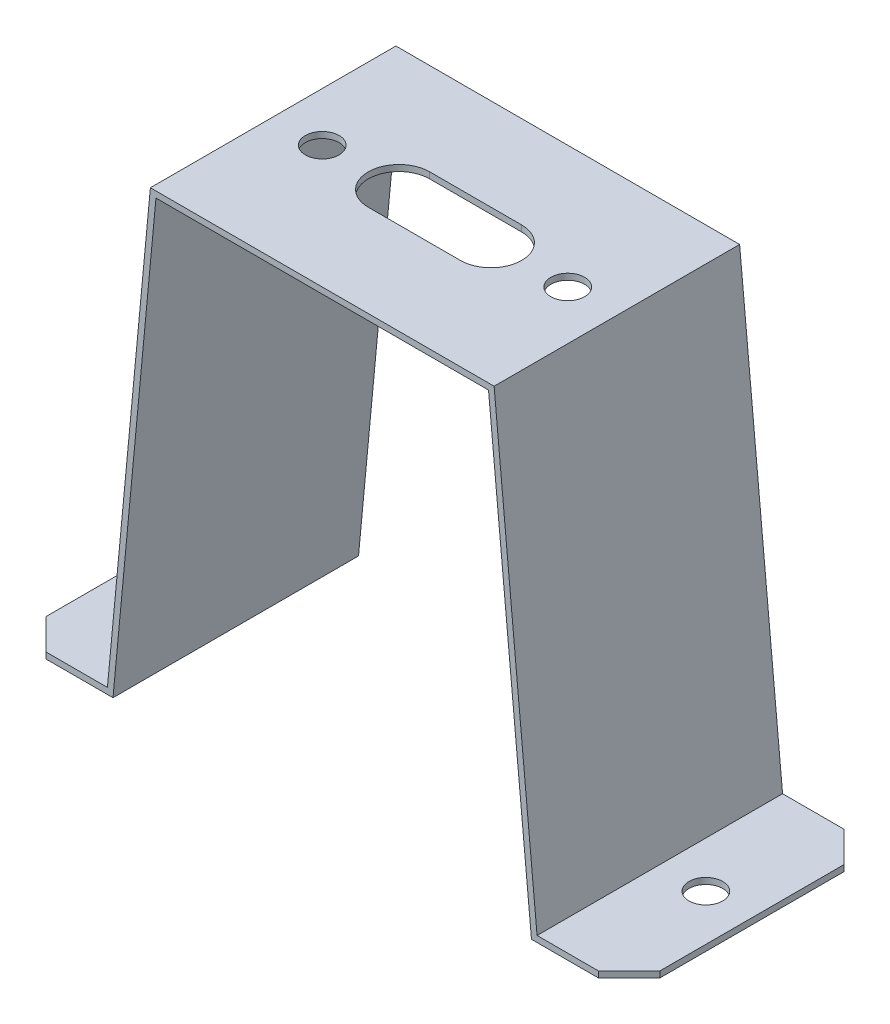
ISO-10303-21;
HEADER;
FILE_DESCRIPTION(('STEP AP214'),'2;1');
FILE_NAME('part.step','',(''),(''),'','','');
FILE_SCHEMA(('AUTOMOTIVE_DESIGN { 1 0 10303 214 1 1 1 1 }'));
ENDSEC;
DATA;
#1=APPLICATION_CONTEXT('core data for automotive mechanical design processes');
#2=APPLICATION_PROTOCOL_DEFINITION('international standard','automotive_design',2000,#1);
#3=PRODUCT_CONTEXT('',#1,'mechanical');
#4=PRODUCT('Part','Part','',(#3));
#5=PRODUCT_RELATED_PRODUCT_CATEGORY('part','',(#4));
#6=PRODUCT_DEFINITION_FORMATION('','',#4);
#7=PRODUCT_DEFINITION_CONTEXT('part definition',#1,'design');
#8=PRODUCT_DEFINITION('design','',#6,#7);
#9=PRODUCT_DEFINITION_SHAPE('','',#8);
#10=(LENGTH_UNIT() NAMED_UNIT(*) SI_UNIT(.MILLI.,.METRE.));
#11=(NAMED_UNIT(*) PLANE_ANGLE_UNIT() SI_UNIT($,.RADIAN.));
#12=(NAMED_UNIT(*) SI_UNIT($,.STERADIAN.) SOLID_ANGLE_UNIT());
#13=UNCERTAINTY_MEASURE_WITH_UNIT(LENGTH_MEASURE(1.E-05),#10,'distance_accuracy_value','');
#14=(GEOMETRIC_REPRESENTATION_CONTEXT(3) GLOBAL_UNCERTAINTY_ASSIGNED_CONTEXT((#13)) GLOBAL_UNIT_ASSIGNED_CONTEXT((#10,
#11,#12)) REPRESENTATION_CONTEXT('',''));
#15=CARTESIAN_POINT('',(0.,0.,0.));
#16=DIRECTION('',(0.,0.,1.));
#17=DIRECTION('',(1.,0.,0.));
#18=AXIS2_PLACEMENT_3D('',#15,#16,#17);
#19=CARTESIAN_POINT('',(0.,0.,40.));
#20=DIRECTION('',(1.,0.,0.));
#21=DIRECTION('',(0.,0.,-1.));
#22=AXIS2_PLACEMENT_3D('',#19,#20,#21);
#23=PLANE('',#22);
#24=DIRECTION('',(0.,0.,-1.));
#25=VECTOR('',#24,1.);
#26=CARTESIAN_POINT('',(0.,0.,40.));
#27=LINE('',#26,#25);
#28=CARTESIAN_POINT('',(0.,0.,35.));
#29=VERTEX_POINT('',#28);
#30=CARTESIAN_POINT('',(0.,0.,5.00000000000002));
#31=VERTEX_POINT('',#30);
#32=EDGE_CURVE('E286',#29,#31,#27,.T.);
#33=ORIENTED_EDGE('',*,*,#32,.F.);
#34=DIRECTION('',(0.,1.,0.));
#35=VECTOR('',#34,1.);
#36=CARTESIAN_POINT('',(0.,0.,35.));
#37=LINE('',#36,#35);
#38=CARTESIAN_POINT('',(0.,1.,35.));
#39=VERTEX_POINT('',#38);
#40=EDGE_CURVE('E299',#29,#39,#37,.T.);
#41=ORIENTED_EDGE('',*,*,#40,.T.);
#42=DIRECTION('',(0.,0.,-1.));
#43=VECTOR('',#42,1.);
#44=CARTESIAN_POINT('',(0.,1.,40.));
#45=LINE('',#44,#43);
#46=CARTESIAN_POINT('',(0.,1.,5.00000000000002));
#47=VERTEX_POINT('',#46);
#48=EDGE_CURVE('E254',#39,#47,#45,.T.);
#49=ORIENTED_EDGE('',*,*,#48,.T.);
#50=DIRECTION('',(0.,-1.,0.));
#51=VECTOR('',#50,1.);
#52=CARTESIAN_POINT('',(0.,0.,5.));
#53=LINE('',#52,#51);
#54=EDGE_CURVE('E296',#47,#31,#53,.T.);
#55=ORIENTED_EDGE('',*,*,#54,.T.);
#56=EDGE_LOOP('',(#33,#41,#49,#55));
#57=FACE_BOUND('',#56,.T.);
#58=ADVANCED_FACE('F30',(#57),#23,.F.);
#59=CARTESIAN_POINT('',(0.,0.,40.));
#60=DIRECTION('',(0.,1.,0.));
#61=DIRECTION('',(0.,0.,1.));
#62=AXIS2_PLACEMENT_3D('',#59,#60,#61);
#63=PLANE('',#62);
#64=CARTESIAN_POINT('',(7.5,0.,20.));
#65=DIRECTION('',(0.,1.,0.));
#66=DIRECTION('',(0.,0.,1.));
#67=AXIS2_PLACEMENT_3D('',#64,#65,#66);
#68=CIRCLE('',#67,2.75);
#69=CARTESIAN_POINT('',(7.5,0.,22.75));
#70=VERTEX_POINT('',#69);
#71=EDGE_CURVE('E619',#70,#70,#68,.T.);
#72=ORIENTED_EDGE('',*,*,#71,.T.);
#73=EDGE_LOOP('',(#72));
#74=FACE_BOUND('',#73,.T.);
#75=DIRECTION('',(1.,0.,0.));
#76=VECTOR('',#75,1.);
#77=CARTESIAN_POINT('',(0.,0.,40.));
#78=LINE('',#77,#76);
#79=CARTESIAN_POINT('',(5.00000000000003,0.,40.));
#80=VERTEX_POINT('',#79);
#81=CARTESIAN_POINT('',(15.909869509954,0.,40.));
#82=VERTEX_POINT('',#81);
#83=EDGE_CURVE('E232',#80,#82,#78,.T.);
#84=ORIENTED_EDGE('',*,*,#83,.F.);
#85=DIRECTION('',(0.707106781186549,0.,0.707106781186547));
#86=VECTOR('',#85,1.);
#87=CARTESIAN_POINT('',(5.00000000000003,0.,40.));
#88=LINE('',#87,#86);
#89=EDGE_CURVE('E294',#80,#29,#88,.F.);
#90=ORIENTED_EDGE('',*,*,#89,.T.);
#91=ORIENTED_EDGE('',*,*,#32,.T.);
#92=DIRECTION('',(0.707106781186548,0.,-0.707106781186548));
#93=VECTOR('',#92,1.);
#94=CARTESIAN_POINT('',(0.,0.,5.));
#95=LINE('',#94,#93);
#96=CARTESIAN_POINT('',(5.,0.,0.));
#97=VERTEX_POINT('',#96);
#98=EDGE_CURVE('E292',#31,#97,#95,.T.);
#99=ORIENTED_EDGE('',*,*,#98,.T.);
#100=DIRECTION('',(1.,0.,0.));
#101=VECTOR('',#100,1.);
#102=CARTESIAN_POINT('',(0.,0.,0.));
#103=LINE('',#102,#101);
#104=CARTESIAN_POINT('',(15.909869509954,0.,0.));
#105=VERTEX_POINT('',#104);
#106=EDGE_CURVE('E211',#97,#105,#103,.T.);
#107=ORIENTED_EDGE('',*,*,#106,.T.);
#108=DIRECTION('',(0.,0.,-1.));
#109=VECTOR('',#108,1.);
#110=CARTESIAN_POINT('',(15.909869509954,0.,40.));
#111=LINE('',#110,#109);
#112=EDGE_CURVE('E283',#82,#105,#111,.T.);
#113=ORIENTED_EDGE('',*,*,#112,.F.);
#114=EDGE_LOOP('',(#84,#90,#91,#99,#107,#113));
#115=FACE_BOUND('',#114,.T.);
#116=ADVANCED_FACE('F367',(#74,#115),#63,.F.);
#117=CARTESIAN_POINT('',(22.909869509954,74.,40.));
#118=DIRECTION('',(-0.995555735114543,0.0941741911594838,0.));
#119=DIRECTION('',(-0.0941741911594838,-0.995555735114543,0.));
#120=AXIS2_PLACEMENT_3D('',#117,#118,#119);
#121=PLANE('',#120);
#122=DIRECTION('',(0.0941741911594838,0.995555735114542,0.));
#123=VECTOR('',#122,1.);
#124=CARTESIAN_POINT('',(22.909869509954,74.,0.));
#125=LINE('',#124,#123);
#126=CARTESIAN_POINT('',(22.909869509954,74.,0.));
#127=VERTEX_POINT('',#126);
#128=EDGE_CURVE('E213',#105,#127,#125,.T.);
#129=ORIENTED_EDGE('',*,*,#128,.T.);
#130=DIRECTION('',(0.,0.,-1.));
#131=VECTOR('',#130,1.);
#132=CARTESIAN_POINT('',(22.909869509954,74.,40.));
#133=LINE('',#132,#131);
#134=CARTESIAN_POINT('',(22.909869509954,74.,40.));
#135=VERTEX_POINT('',#134);
#136=EDGE_CURVE('E280',#135,#127,#133,.T.);
#137=ORIENTED_EDGE('',*,*,#136,.F.);
#138=DIRECTION('',(0.0941741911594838,0.995555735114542,0.));
#139=VECTOR('',#138,1.);
#140=CARTESIAN_POINT('',(22.909869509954,74.,40.));
#141=LINE('',#140,#139);
#142=EDGE_CURVE('E234',#82,#135,#141,.T.);
#143=ORIENTED_EDGE('',*,*,#142,.F.);
#144=ORIENTED_EDGE('',*,*,#112,.T.);
#145=EDGE_LOOP('',(#129,#137,#143,#144));
#146=FACE_BOUND('',#145,.T.);
#147=ADVANCED_FACE('F374',(#146),#121,.F.);
#148=CARTESIAN_POINT('',(22.909869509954,74.,40.));
#149=DIRECTION('',(0.,1.,0.));
#150=DIRECTION('',(0.,0.,1.));
#151=AXIS2_PLACEMENT_3D('',#148,#149,#150);
#152=PLANE('',#151);
#153=CARTESIAN_POINT('',(30.,74.,20.));
#154=DIRECTION('',(0.,1.,0.));
#155=DIRECTION('',(0.,0.,1.));
#156=AXIS2_PLACEMENT_3D('',#153,#154,#155);
#157=CIRCLE('',#156,2.75);
#158=CARTESIAN_POINT('',(30.,74.,22.75));
#159=VERTEX_POINT('',#158);
#160=EDGE_CURVE('E632',#159,#159,#157,.T.);
#161=ORIENTED_EDGE('',*,*,#160,.T.);
#162=EDGE_LOOP('',(#161));
#163=FACE_BOUND('',#162,.T.);
#164=CARTESIAN_POINT('',(70.,74.,20.));
#165=DIRECTION('',(0.,1.,0.));
#166=DIRECTION('',(0.,0.,1.));
#167=AXIS2_PLACEMENT_3D('',#164,#165,#166);
#168=CIRCLE('',#167,2.75000000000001);
#169=CARTESIAN_POINT('',(70.,74.,22.75));
#170=VERTEX_POINT('',#169);
#171=EDGE_CURVE('E638',#170,#170,#168,.T.);
#172=ORIENTED_EDGE('',*,*,#171,.T.);
#173=EDGE_LOOP('',(#172));
#174=FACE_BOUND('',#173,.T.);
#175=DIRECTION('',(1.,0.,0.));
#176=VECTOR('',#175,1.);
#177=CARTESIAN_POINT('',(22.909869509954,74.,25.));
#178=LINE('',#177,#176);
#179=CARTESIAN_POINT('',(42.5,74.,25.));
#180=VERTEX_POINT('',#179);
#181=CARTESIAN_POINT('',(57.5,74.,25.));
#182=VERTEX_POINT('',#181);
#183=EDGE_CURVE('E205',#180,#182,#178,.T.);
#184=ORIENTED_EDGE('',*,*,#183,.T.);
#185=CARTESIAN_POINT('',(57.5,74.,20.));
#186=DIRECTION('',(0.,1.,0.));
#187=DIRECTION('',(0.,0.,1.));
#188=AXIS2_PLACEMENT_3D('',#185,#186,#187);
#189=CIRCLE('',#188,5.);
#190=CARTESIAN_POINT('',(57.5,74.,15.));
#191=VERTEX_POINT('',#190);
#192=EDGE_CURVE('E208',#182,#191,#189,.T.);
#193=ORIENTED_EDGE('',*,*,#192,.T.);
#194=DIRECTION('',(-1.,0.,0.));
#195=VECTOR('',#194,1.);
#196=CARTESIAN_POINT('',(22.909869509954,74.,15.));
#197=LINE('',#196,#195);
#198=CARTESIAN_POINT('',(42.5,74.,15.));
#199=VERTEX_POINT('',#198);
#200=EDGE_CURVE('E200',#191,#199,#197,.T.);
#201=ORIENTED_EDGE('',*,*,#200,.T.);
#202=CARTESIAN_POINT('',(42.5,74.,20.));
#203=DIRECTION('',(0.,1.,0.));
#204=DIRECTION('',(0.,0.,1.));
#205=AXIS2_PLACEMENT_3D('',#202,#203,#204);
#206=CIRCLE('',#205,5.);
#207=EDGE_CURVE('E175',#199,#180,#206,.T.);
#208=ORIENTED_EDGE('',*,*,#207,.T.);
#209=EDGE_LOOP('',(#184,#193,#201,#208));
#210=FACE_BOUND('',#209,.T.);
#211=DIRECTION('',(1.,0.,0.));
#212=VECTOR('',#211,1.);
#213=CARTESIAN_POINT('',(22.909869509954,74.,0.));
#214=LINE('',#213,#212);
#215=CARTESIAN_POINT('',(77.090130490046,74.,0.));
#216=VERTEX_POINT('',#215);
#217=EDGE_CURVE('E215',#127,#216,#214,.T.);
#218=ORIENTED_EDGE('',*,*,#217,.T.);
#219=DIRECTION('',(0.,0.,-1.));
#220=VECTOR('',#219,1.);
#221=CARTESIAN_POINT('',(77.090130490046,74.,40.));
#222=LINE('',#221,#220);
#223=CARTESIAN_POINT('',(77.090130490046,74.,40.));
#224=VERTEX_POINT('',#223);
#225=EDGE_CURVE('E277',#224,#216,#222,.T.);
#226=ORIENTED_EDGE('',*,*,#225,.F.);
#227=DIRECTION('',(1.,0.,0.));
#228=VECTOR('',#227,1.);
#229=CARTESIAN_POINT('',(22.909869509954,74.,40.));
#230=LINE('',#229,#228);
#231=EDGE_CURVE('E236',#135,#224,#230,.T.);
#232=ORIENTED_EDGE('',*,*,#231,.F.);
#233=ORIENTED_EDGE('',*,*,#136,.T.);
#234=EDGE_LOOP('',(#218,#226,#232,#233));
#235=FACE_BOUND('',#234,.T.);
#236=ADVANCED_FACE('F378',(#163,#174,#210,#235),#152,.F.);
#237=CARTESIAN_POINT('',(77.090130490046,74.,40.));
#238=DIRECTION('',(0.995555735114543,0.0941741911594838,0.));
#239=DIRECTION('',(-0.0941741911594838,0.995555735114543,0.));
#240=AXIS2_PLACEMENT_3D('',#237,#238,#239);
#241=PLANE('',#240);
#242=DIRECTION('',(0.0941741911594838,-0.995555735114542,0.));
#243=VECTOR('',#242,1.);
#244=CARTESIAN_POINT('',(77.090130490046,74.,0.));
#245=LINE('',#244,#243);
#246=CARTESIAN_POINT('',(84.0901304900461,0.,0.));
#247=VERTEX_POINT('',#246);
#248=EDGE_CURVE('E217',#216,#247,#245,.T.);
#249=ORIENTED_EDGE('',*,*,#248,.T.);
#250=DIRECTION('',(0.,0.,-1.));
#251=VECTOR('',#250,1.);
#252=CARTESIAN_POINT('',(84.0901304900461,0.,40.));
#253=LINE('',#252,#251);
#254=CARTESIAN_POINT('',(84.0901304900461,0.,40.));
#255=VERTEX_POINT('',#254);
#256=EDGE_CURVE('E274',#255,#247,#253,.T.);
#257=ORIENTED_EDGE('',*,*,#256,.F.);
#258=DIRECTION('',(0.0941741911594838,-0.995555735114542,0.));
#259=VECTOR('',#258,1.);
#260=CARTESIAN_POINT('',(77.090130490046,74.,40.));
#261=LINE('',#260,#259);
#262=EDGE_CURVE('E238',#224,#255,#261,.T.);
#263=ORIENTED_EDGE('',*,*,#262,.F.);
#264=ORIENTED_EDGE('',*,*,#225,.T.);
#265=EDGE_LOOP('',(#249,#257,#263,#264));
#266=FACE_BOUND('',#265,.T.);
#267=ADVANCED_FACE('F382',(#266),#241,.F.);
#268=CARTESIAN_POINT('',(84.0901304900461,0.,40.));
#269=DIRECTION('',(0.,1.,0.));
#270=DIRECTION('',(-1.,0.,0.));
#271=AXIS2_PLACEMENT_3D('',#268,#269,#270);
#272=PLANE('',#271);
#273=CARTESIAN_POINT('',(92.5,0.,20.));
#274=DIRECTION('',(0.,1.,0.));
#275=DIRECTION('',(-1.,0.,0.));
#276=AXIS2_PLACEMENT_3D('',#273,#274,#275);
#277=CIRCLE('',#276,2.75000000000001);
#278=CARTESIAN_POINT('',(89.75,0.,20.));
#279=VERTEX_POINT('',#278);
#280=EDGE_CURVE('E623',#279,#279,#277,.T.);
#281=ORIENTED_EDGE('',*,*,#280,.T.);
#282=EDGE_LOOP('',(#281));
#283=FACE_BOUND('',#282,.T.);
#284=DIRECTION('',(0.,0.,-1.));
#285=VECTOR('',#284,1.);
#286=CARTESIAN_POINT('',(100.,0.,40.));
#287=LINE('',#286,#285);
#288=CARTESIAN_POINT('',(100.,0.,35.));
#289=VERTEX_POINT('',#288);
#290=CARTESIAN_POINT('',(100.,0.,5.));
#291=VERTEX_POINT('',#290);
#292=EDGE_CURVE('E272',#289,#291,#287,.T.);
#293=ORIENTED_EDGE('',*,*,#292,.F.);
#294=DIRECTION('',(0.707106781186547,0.,-0.707106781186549));
#295=VECTOR('',#294,1.);
#296=CARTESIAN_POINT('',(95.,0.,40.));
#297=LINE('',#296,#295);
#298=CARTESIAN_POINT('',(95.,0.,40.));
#299=VERTEX_POINT('',#298);
#300=EDGE_CURVE('E37',#289,#299,#297,.F.);
#301=ORIENTED_EDGE('',*,*,#300,.T.);
#302=DIRECTION('',(1.,0.,0.));
#303=VECTOR('',#302,1.);
#304=CARTESIAN_POINT('',(84.0901304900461,0.,40.));
#305=LINE('',#304,#303);
#306=EDGE_CURVE('E240',#255,#299,#305,.T.);
#307=ORIENTED_EDGE('',*,*,#306,.F.);
#308=ORIENTED_EDGE('',*,*,#256,.T.);
#309=DIRECTION('',(1.,0.,0.));
#310=VECTOR('',#309,1.);
#311=CARTESIAN_POINT('',(84.0901304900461,0.,0.));
#312=LINE('',#311,#310);
#313=CARTESIAN_POINT('',(95.,0.,0.));
#314=VERTEX_POINT('',#313);
#315=EDGE_CURVE('E219',#247,#314,#312,.T.);
#316=ORIENTED_EDGE('',*,*,#315,.T.);
#317=DIRECTION('',(0.707106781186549,0.,0.707106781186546));
#318=VECTOR('',#317,1.);
#319=CARTESIAN_POINT('',(100.,0.,5.));
#320=LINE('',#319,#318);
#321=EDGE_CURVE('E49',#314,#291,#320,.T.);
#322=ORIENTED_EDGE('',*,*,#321,.T.);
#323=EDGE_LOOP('',(#293,#301,#307,#308,#316,#322));
#324=FACE_BOUND('',#323,.T.);
#325=ADVANCED_FACE('F321',(#283,#324),#272,.F.);
#326=CARTESIAN_POINT('',(100.,0.,40.));
#327=DIRECTION('',(-1.,0.,0.));
#328=DIRECTION('',(0.,0.,1.));
#329=AXIS2_PLACEMENT_3D('',#326,#327,#328);
#330=PLANE('',#329);
#331=DIRECTION('',(0.,0.,-1.));
#332=VECTOR('',#331,1.);
#333=CARTESIAN_POINT('',(100.,1.,40.));
#334=LINE('',#333,#332);
#335=CARTESIAN_POINT('',(100.,1.,35.));
#336=VERTEX_POINT('',#335);
#337=CARTESIAN_POINT('',(100.,1.,5.));
#338=VERTEX_POINT('',#337);
#339=EDGE_CURVE('E269',#336,#338,#334,.T.);
#340=ORIENTED_EDGE('',*,*,#339,.F.);
#341=DIRECTION('',(0.,-1.,0.));
#342=VECTOR('',#341,1.);
#343=CARTESIAN_POINT('',(100.,0.,35.));
#344=LINE('',#343,#342);
#345=EDGE_CURVE('E317',#336,#289,#344,.T.);
#346=ORIENTED_EDGE('',*,*,#345,.T.);
#347=ORIENTED_EDGE('',*,*,#292,.T.);
#348=DIRECTION('',(0.,1.,0.));
#349=VECTOR('',#348,1.);
#350=CARTESIAN_POINT('',(100.,1.,5.));
#351=LINE('',#350,#349);
#352=EDGE_CURVE('E314',#291,#338,#351,.T.);
#353=ORIENTED_EDGE('',*,*,#352,.T.);
#354=EDGE_LOOP('',(#340,#346,#347,#353));
#355=FACE_BOUND('',#354,.T.);
#356=ADVANCED_FACE('F336',(#355),#330,.F.);
#357=CARTESIAN_POINT('',(85.,1.,40.));
#358=DIRECTION('',(0.,-1.,0.));
#359=DIRECTION('',(0.,0.,-1.));
#360=AXIS2_PLACEMENT_3D('',#357,#358,#359);
#361=PLANE('',#360);
#362=CARTESIAN_POINT('',(92.5,1.,20.));
#363=DIRECTION('',(0.,1.,0.));
#364=DIRECTION('',(0.,0.,1.));
#365=AXIS2_PLACEMENT_3D('',#362,#363,#364);
#366=CIRCLE('',#365,2.75000000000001);
#367=CARTESIAN_POINT('',(92.5,1.,22.75));
#368=VERTEX_POINT('',#367);
#369=EDGE_CURVE('E620',#368,#368,#366,.T.);
#370=ORIENTED_EDGE('',*,*,#369,.F.);
#371=EDGE_LOOP('',(#370));
#372=FACE_BOUND('',#371,.T.);
#373=DIRECTION('',(-1.,0.,0.));
#374=VECTOR('',#373,1.);
#375=CARTESIAN_POINT('',(85.,1.,40.));
#376=LINE('',#375,#374);
#377=CARTESIAN_POINT('',(95.,1.,40.));
#378=VERTEX_POINT('',#377);
#379=CARTESIAN_POINT('',(85.,1.,40.));
#380=VERTEX_POINT('',#379);
#381=EDGE_CURVE('E243',#378,#380,#376,.T.);
#382=ORIENTED_EDGE('',*,*,#381,.F.);
#383=DIRECTION('',(-0.707106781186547,0.,0.707106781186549));
#384=VECTOR('',#383,1.);
#385=CARTESIAN_POINT('',(95.,1.,40.));
#386=LINE('',#385,#384);
#387=EDGE_CURVE('E312',#378,#336,#386,.F.);
#388=ORIENTED_EDGE('',*,*,#387,.T.);
#389=ORIENTED_EDGE('',*,*,#339,.T.);
#390=DIRECTION('',(-0.707106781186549,0.,-0.707106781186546));
#391=VECTOR('',#390,1.);
#392=CARTESIAN_POINT('',(100.,1.,5.));
#393=LINE('',#392,#391);
#394=CARTESIAN_POINT('',(95.,1.,0.));
#395=VERTEX_POINT('',#394);
#396=EDGE_CURVE('E310',#338,#395,#393,.T.);
#397=ORIENTED_EDGE('',*,*,#396,.T.);
#398=DIRECTION('',(-1.,0.,0.));
#399=VECTOR('',#398,1.);
#400=CARTESIAN_POINT('',(85.,1.,0.));
#401=LINE('',#400,#399);
#402=CARTESIAN_POINT('',(85.,1.,0.));
#403=VERTEX_POINT('',#402);
#404=EDGE_CURVE('E221',#395,#403,#401,.T.);
#405=ORIENTED_EDGE('',*,*,#404,.T.);
#406=DIRECTION('',(0.,0.,-1.));
#407=VECTOR('',#406,1.);
#408=CARTESIAN_POINT('',(85.,1.,40.));
#409=LINE('',#408,#407);
#410=EDGE_CURVE('E266',#380,#403,#409,.T.);
#411=ORIENTED_EDGE('',*,*,#410,.F.);
#412=EDGE_LOOP('',(#382,#388,#389,#397,#405,#411));
#413=FACE_BOUND('',#412,.T.);
#414=ADVANCED_FACE('F333',(#372,#413),#361,.F.);
#415=CARTESIAN_POINT('',(78.,75.,40.));
#416=DIRECTION('',(-0.995555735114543,-0.0941741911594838,0.));
#417=DIRECTION('',(0.0941741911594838,-0.995555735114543,0.));
#418=AXIS2_PLACEMENT_3D('',#415,#416,#417);
#419=PLANE('',#418);
#420=DIRECTION('',(-0.0941741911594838,0.995555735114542,0.));
#421=VECTOR('',#420,1.);
#422=CARTESIAN_POINT('',(78.,75.,0.));
#423=LINE('',#422,#421);
#424=CARTESIAN_POINT('',(78.,75.,0.));
#425=VERTEX_POINT('',#424);
#426=EDGE_CURVE('E223',#403,#425,#423,.T.);
#427=ORIENTED_EDGE('',*,*,#426,.T.);
#428=DIRECTION('',(0.,0.,-1.));
#429=VECTOR('',#428,1.);
#430=CARTESIAN_POINT('',(78.,75.,40.));
#431=LINE('',#430,#429);
#432=CARTESIAN_POINT('',(78.,75.,40.));
#433=VERTEX_POINT('',#432);
#434=EDGE_CURVE('E263',#433,#425,#431,.T.);
#435=ORIENTED_EDGE('',*,*,#434,.F.);
#436=DIRECTION('',(-0.0941741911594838,0.995555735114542,0.));
#437=VECTOR('',#436,1.);
#438=CARTESIAN_POINT('',(78.,75.,40.));
#439=LINE('',#438,#437);
#440=EDGE_CURVE('E245',#380,#433,#439,.T.);
#441=ORIENTED_EDGE('',*,*,#440,.F.);
#442=ORIENTED_EDGE('',*,*,#410,.T.);
#443=EDGE_LOOP('',(#427,#435,#441,#442));
#444=FACE_BOUND('',#443,.T.);
#445=ADVANCED_FACE('F346',(#444),#419,.F.);
#446=CARTESIAN_POINT('',(22.,75.,40.));
#447=DIRECTION('',(0.,-1.,0.));
#448=DIRECTION('',(0.,0.,-1.));
#449=AXIS2_PLACEMENT_3D('',#446,#447,#448);
#450=PLANE('',#449);
#451=CARTESIAN_POINT('',(30.,75.,20.));
#452=DIRECTION('',(0.,1.,0.));
#453=DIRECTION('',(0.,0.,1.));
#454=AXIS2_PLACEMENT_3D('',#451,#452,#453);
#455=CIRCLE('',#454,2.75);
#456=CARTESIAN_POINT('',(30.,75.,22.75));
#457=VERTEX_POINT('',#456);
#458=EDGE_CURVE('E629',#457,#457,#455,.T.);
#459=ORIENTED_EDGE('',*,*,#458,.F.);
#460=EDGE_LOOP('',(#459));
#461=FACE_BOUND('',#460,.T.);
#462=CARTESIAN_POINT('',(70.,75.,20.));
#463=DIRECTION('',(0.,1.,0.));
#464=DIRECTION('',(0.,0.,1.));
#465=AXIS2_PLACEMENT_3D('',#462,#463,#464);
#466=CIRCLE('',#465,2.75000000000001);
#467=CARTESIAN_POINT('',(70.,75.,22.75));
#468=VERTEX_POINT('',#467);
#469=EDGE_CURVE('E635',#468,#468,#466,.T.);
#470=ORIENTED_EDGE('',*,*,#469,.F.);
#471=EDGE_LOOP('',(#470));
#472=FACE_BOUND('',#471,.T.);
#473=DIRECTION('',(-1.,0.,0.));
#474=VECTOR('',#473,1.);
#475=CARTESIAN_POINT('',(42.5,75.,15.));
#476=LINE('',#475,#474);
#477=CARTESIAN_POINT('',(57.5,75.,15.));
#478=VERTEX_POINT('',#477);
#479=CARTESIAN_POINT('',(42.5,75.,15.));
#480=VERTEX_POINT('',#479);
#481=EDGE_CURVE('E183',#478,#480,#476,.T.);
#482=ORIENTED_EDGE('',*,*,#481,.F.);
#483=CARTESIAN_POINT('',(57.5,75.,20.));
#484=DIRECTION('',(0.,1.,0.));
#485=DIRECTION('',(0.,0.,1.));
#486=AXIS2_PLACEMENT_3D('',#483,#484,#485);
#487=CIRCLE('',#486,5.);
#488=CARTESIAN_POINT('',(57.5,75.,25.));
#489=VERTEX_POINT('',#488);
#490=EDGE_CURVE('E188',#489,#478,#487,.T.);
#491=ORIENTED_EDGE('',*,*,#490,.F.);
#492=DIRECTION('',(1.,0.,0.));
#493=VECTOR('',#492,1.);
#494=CARTESIAN_POINT('',(42.5,75.,25.));
#495=LINE('',#494,#493);
#496=CARTESIAN_POINT('',(42.5,75.,25.));
#497=VERTEX_POINT('',#496);
#498=EDGE_CURVE('E193',#497,#489,#495,.T.);
#499=ORIENTED_EDGE('',*,*,#498,.F.);
#500=CARTESIAN_POINT('',(42.5,75.,20.));
#501=DIRECTION('',(0.,1.,0.));
#502=DIRECTION('',(0.,0.,1.));
#503=AXIS2_PLACEMENT_3D('',#500,#501,#502);
#504=CIRCLE('',#503,5.);
#505=EDGE_CURVE('E172',#480,#497,#504,.T.);
#506=ORIENTED_EDGE('',*,*,#505,.F.);
#507=EDGE_LOOP('',(#482,#491,#499,#506));
#508=FACE_BOUND('',#507,.T.);
#509=DIRECTION('',(-1.,0.,0.));
#510=VECTOR('',#509,1.);
#511=CARTESIAN_POINT('',(22.,75.,0.));
#512=LINE('',#511,#510);
#513=CARTESIAN_POINT('',(22.,75.,0.));
#514=VERTEX_POINT('',#513);
#515=EDGE_CURVE('E225',#425,#514,#512,.T.);
#516=ORIENTED_EDGE('',*,*,#515,.T.);
#517=DIRECTION('',(0.,0.,-1.));
#518=VECTOR('',#517,1.);
#519=CARTESIAN_POINT('',(22.,75.,40.));
#520=LINE('',#519,#518);
#521=CARTESIAN_POINT('',(22.,75.,40.));
#522=VERTEX_POINT('',#521);
#523=EDGE_CURVE('E260',#522,#514,#520,.T.);
#524=ORIENTED_EDGE('',*,*,#523,.F.);
#525=DIRECTION('',(-1.,0.,0.));
#526=VECTOR('',#525,1.);
#527=CARTESIAN_POINT('',(22.,75.,40.));
#528=LINE('',#527,#526);
#529=EDGE_CURVE('E247',#433,#522,#528,.T.);
#530=ORIENTED_EDGE('',*,*,#529,.F.);
#531=ORIENTED_EDGE('',*,*,#434,.T.);
#532=EDGE_LOOP('',(#516,#524,#530,#531));
#533=FACE_BOUND('',#532,.T.);
#534=ADVANCED_FACE('F190',(#461,#472,#508,#533),#450,.F.);
#535=CARTESIAN_POINT('',(22.,75.,40.));
#536=DIRECTION('',(0.995555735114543,-0.0941741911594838,0.));
#537=DIRECTION('',(0.0941741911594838,0.995555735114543,0.));
#538=AXIS2_PLACEMENT_3D('',#535,#536,#537);
#539=PLANE('',#538);
#540=DIRECTION('',(-0.0941741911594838,-0.995555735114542,0.));
#541=VECTOR('',#540,1.);
#542=CARTESIAN_POINT('',(22.,75.,0.));
#543=LINE('',#542,#541);
#544=CARTESIAN_POINT('',(15.,1.,0.));
#545=VERTEX_POINT('',#544);
#546=EDGE_CURVE('E227',#514,#545,#543,.T.);
#547=ORIENTED_EDGE('',*,*,#546,.T.);
#548=DIRECTION('',(0.,0.,-1.));
#549=VECTOR('',#548,1.);
#550=CARTESIAN_POINT('',(15.,1.,40.));
#551=LINE('',#550,#549);
#552=CARTESIAN_POINT('',(15.,1.,40.));
#553=VERTEX_POINT('',#552);
#554=EDGE_CURVE('E257',#553,#545,#551,.T.);
#555=ORIENTED_EDGE('',*,*,#554,.F.);
#556=DIRECTION('',(-0.0941741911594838,-0.995555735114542,0.));
#557=VECTOR('',#556,1.);
#558=CARTESIAN_POINT('',(22.,75.,40.));
#559=LINE('',#558,#557);
#560=EDGE_CURVE('E249',#522,#553,#559,.T.);
#561=ORIENTED_EDGE('',*,*,#560,.F.);
#562=ORIENTED_EDGE('',*,*,#523,.T.);
#563=EDGE_LOOP('',(#547,#555,#561,#562));
#564=FACE_BOUND('',#563,.T.);
#565=ADVANCED_FACE('F355',(#564),#539,.F.);
#566=CARTESIAN_POINT('',(0.,1.,40.));
#567=DIRECTION('',(0.,-1.,0.));
#568=DIRECTION('',(0.,0.,-1.));
#569=AXIS2_PLACEMENT_3D('',#566,#567,#568);
#570=PLANE('',#569);
#571=CARTESIAN_POINT('',(7.5,1.,20.));
#572=DIRECTION('',(0.,1.,0.));
#573=DIRECTION('',(0.,0.,1.));
#574=AXIS2_PLACEMENT_3D('',#571,#572,#573);
#575=CIRCLE('',#574,2.75);
#576=CARTESIAN_POINT('',(7.5,1.,22.75));
#577=VERTEX_POINT('',#576);
#578=EDGE_CURVE('E617',#577,#577,#575,.T.);
#579=ORIENTED_EDGE('',*,*,#578,.F.);
#580=EDGE_LOOP('',(#579));
#581=FACE_BOUND('',#580,.T.);
#582=ORIENTED_EDGE('',*,*,#48,.F.);
#583=DIRECTION('',(-0.707106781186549,0.,-0.707106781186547));
#584=VECTOR('',#583,1.);
#585=CARTESIAN_POINT('',(5.00000000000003,1.,40.));
#586=LINE('',#585,#584);
#587=CARTESIAN_POINT('',(5.00000000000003,1.,40.));
#588=VERTEX_POINT('',#587);
#589=EDGE_CURVE('E303',#39,#588,#586,.F.);
#590=ORIENTED_EDGE('',*,*,#589,.T.);
#591=DIRECTION('',(-1.,0.,0.));
#592=VECTOR('',#591,1.);
#593=CARTESIAN_POINT('',(0.,1.,40.));
#594=LINE('',#593,#592);
#595=EDGE_CURVE('E251',#553,#588,#594,.T.);
#596=ORIENTED_EDGE('',*,*,#595,.F.);
#597=ORIENTED_EDGE('',*,*,#554,.T.);
#598=DIRECTION('',(-1.,0.,0.));
#599=VECTOR('',#598,1.);
#600=CARTESIAN_POINT('',(0.,1.,0.));
#601=LINE('',#600,#599);
#602=CARTESIAN_POINT('',(5.,1.,0.));
#603=VERTEX_POINT('',#602);
#604=EDGE_CURVE('E229',#545,#603,#601,.T.);
#605=ORIENTED_EDGE('',*,*,#604,.T.);
#606=DIRECTION('',(-0.707106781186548,0.,0.707106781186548));
#607=VECTOR('',#606,1.);
#608=CARTESIAN_POINT('',(0.,1.,5.));
#609=LINE('',#608,#607);
#610=EDGE_CURVE('E301',#603,#47,#609,.T.);
#611=ORIENTED_EDGE('',*,*,#610,.T.);
#612=EDGE_LOOP('',(#582,#590,#596,#597,#605,#611));
#613=FACE_BOUND('',#612,.T.);
#614=ADVANCED_FACE('F359',(#581,#613),#570,.F.);
#615=CARTESIAN_POINT('',(0.,1.,40.));
#616=DIRECTION('',(0.,0.,-1.));
#617=DIRECTION('',(-1.,0.,0.));
#618=AXIS2_PLACEMENT_3D('',#615,#616,#617);
#619=PLANE('',#618);
#620=ORIENTED_EDGE('',*,*,#306,.T.);
#621=DIRECTION('',(0.,1.,0.));
#622=VECTOR('',#621,1.);
#623=CARTESIAN_POINT('',(95.,1.,40.));
#624=LINE('',#623,#622);
#625=EDGE_CURVE('E307',#299,#378,#624,.T.);
#626=ORIENTED_EDGE('',*,*,#625,.T.);
#627=ORIENTED_EDGE('',*,*,#381,.T.);
#628=ORIENTED_EDGE('',*,*,#440,.T.);
#629=ORIENTED_EDGE('',*,*,#529,.T.);
#630=ORIENTED_EDGE('',*,*,#560,.T.);
#631=ORIENTED_EDGE('',*,*,#595,.T.);
#632=DIRECTION('',(0.,-1.,0.));
#633=VECTOR('',#632,1.);
#634=CARTESIAN_POINT('',(5.00000000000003,1.,40.));
#635=LINE('',#634,#633);
#636=EDGE_CURVE('E289',#588,#80,#635,.T.);
#637=ORIENTED_EDGE('',*,*,#636,.T.);
#638=ORIENTED_EDGE('',*,*,#83,.T.);
#639=ORIENTED_EDGE('',*,*,#142,.T.);
#640=ORIENTED_EDGE('',*,*,#231,.T.);
#641=ORIENTED_EDGE('',*,*,#262,.T.);
#642=EDGE_LOOP('',(#620,#626,#627,#628,#629,#630,#631,#637,#638,#639,#640,#641));
#643=FACE_BOUND('',#642,.T.);
#644=ADVANCED_FACE('F326',(#643),#619,.F.);
#645=CARTESIAN_POINT('',(0.,1.,0.));
#646=DIRECTION('',(0.,0.,-1.));
#647=DIRECTION('',(-1.,0.,0.));
#648=AXIS2_PLACEMENT_3D('',#645,#646,#647);
#649=PLANE('',#648);
#650=ORIENTED_EDGE('',*,*,#404,.F.);
#651=DIRECTION('',(0.,-1.,0.));
#652=VECTOR('',#651,1.);
#653=CARTESIAN_POINT('',(95.,0.,0.));
#654=LINE('',#653,#652);
#655=EDGE_CURVE('E11',#395,#314,#654,.T.);
#656=ORIENTED_EDGE('',*,*,#655,.T.);
#657=ORIENTED_EDGE('',*,*,#315,.F.);
#658=ORIENTED_EDGE('',*,*,#248,.F.);
#659=ORIENTED_EDGE('',*,*,#217,.F.);
#660=ORIENTED_EDGE('',*,*,#128,.F.);
#661=ORIENTED_EDGE('',*,*,#106,.F.);
#662=DIRECTION('',(0.,1.,0.));
#663=VECTOR('',#662,1.);
#664=CARTESIAN_POINT('',(5.,1.,0.));
#665=LINE('',#664,#663);
#666=EDGE_CURVE('E305',#97,#603,#665,.T.);
#667=ORIENTED_EDGE('',*,*,#666,.T.);
#668=ORIENTED_EDGE('',*,*,#604,.F.);
#669=ORIENTED_EDGE('',*,*,#546,.F.);
#670=ORIENTED_EDGE('',*,*,#515,.F.);
#671=ORIENTED_EDGE('',*,*,#426,.F.);
#672=EDGE_LOOP('',(#650,#656,#657,#658,#659,#660,#661,#667,#668,#669,#670,#671));
#673=FACE_BOUND('',#672,.T.);
#674=ADVANCED_FACE('F341',(#673),#649,.T.);
#675=CARTESIAN_POINT('',(57.5,35.,20.));
#676=DIRECTION('',(0.,1.,0.));
#677=DIRECTION('',(0.,0.,1.));
#678=AXIS2_PLACEMENT_3D('',#675,#676,#677);
#679=CYLINDRICAL_SURFACE('',#678,5.);
#680=DIRECTION('',(0.,1.,0.));
#681=VECTOR('',#680,1.);
#682=CARTESIAN_POINT('',(57.5,35.,25.));
#683=LINE('',#682,#681);
#684=EDGE_CURVE('E198',#182,#489,#683,.T.);
#685=ORIENTED_EDGE('',*,*,#684,.T.);
#686=ORIENTED_EDGE('',*,*,#490,.T.);
#687=DIRECTION('',(0.,1.,0.));
#688=VECTOR('',#687,1.);
#689=CARTESIAN_POINT('',(57.5,35.,15.));
#690=LINE('',#689,#688);
#691=EDGE_CURVE('E179',#191,#478,#690,.T.);
#692=ORIENTED_EDGE('',*,*,#691,.F.);
#693=ORIENTED_EDGE('',*,*,#192,.F.);
#694=EDGE_LOOP('',(#685,#686,#692,#693));
#695=FACE_BOUND('',#694,.T.);
#696=ADVANCED_FACE('F427',(#695),#679,.F.);
#697=CARTESIAN_POINT('',(42.5,35.,25.));
#698=DIRECTION('',(0.,0.,1.));
#699=DIRECTION('',(1.,0.,0.));
#700=AXIS2_PLACEMENT_3D('',#697,#698,#699);
#701=PLANE('',#700);
#702=DIRECTION('',(0.,1.,0.));
#703=VECTOR('',#702,1.);
#704=CARTESIAN_POINT('',(42.5,35.,25.));
#705=LINE('',#704,#703);
#706=EDGE_CURVE('E178',#180,#497,#705,.T.);
#707=ORIENTED_EDGE('',*,*,#706,.T.);
#708=ORIENTED_EDGE('',*,*,#498,.T.);
#709=ORIENTED_EDGE('',*,*,#684,.F.);
#710=ORIENTED_EDGE('',*,*,#183,.F.);
#711=EDGE_LOOP('',(#707,#708,#709,#710));
#712=FACE_BOUND('',#711,.T.);
#713=ADVANCED_FACE('F430',(#712),#701,.F.);
#714=CARTESIAN_POINT('',(42.5,35.,20.));
#715=DIRECTION('',(0.,1.,0.));
#716=DIRECTION('',(0.,0.,1.));
#717=AXIS2_PLACEMENT_3D('',#714,#715,#716);
#718=CYLINDRICAL_SURFACE('',#717,5.);
#719=DIRECTION('',(0.,1.,0.));
#720=VECTOR('',#719,1.);
#721=CARTESIAN_POINT('',(42.5,35.,15.));
#722=LINE('',#721,#720);
#723=EDGE_CURVE('E167',#199,#480,#722,.T.);
#724=ORIENTED_EDGE('',*,*,#723,.T.);
#725=ORIENTED_EDGE('',*,*,#505,.T.);
#726=ORIENTED_EDGE('',*,*,#706,.F.);
#727=ORIENTED_EDGE('',*,*,#207,.F.);
#728=EDGE_LOOP('',(#724,#725,#726,#727));
#729=FACE_BOUND('',#728,.T.);
#730=ADVANCED_FACE('F169',(#729),#718,.F.);
#731=CARTESIAN_POINT('',(42.5,35.,15.));
#732=DIRECTION('',(0.,0.,-1.));
#733=DIRECTION('',(-1.,0.,0.));
#734=AXIS2_PLACEMENT_3D('',#731,#732,#733);
#735=PLANE('',#734);
#736=ORIENTED_EDGE('',*,*,#691,.T.);
#737=ORIENTED_EDGE('',*,*,#481,.T.);
#738=ORIENTED_EDGE('',*,*,#723,.F.);
#739=ORIENTED_EDGE('',*,*,#200,.F.);
#740=EDGE_LOOP('',(#736,#737,#738,#739));
#741=FACE_BOUND('',#740,.T.);
#742=ADVANCED_FACE('F184',(#741),#735,.F.);
#743=CARTESIAN_POINT('',(70.,35.,20.));
#744=DIRECTION('',(0.,1.,0.));
#745=DIRECTION('',(0.,0.,1.));
#746=AXIS2_PLACEMENT_3D('',#743,#744,#745);
#747=CYLINDRICAL_SURFACE('',#746,2.75000000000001);
#748=ORIENTED_EDGE('',*,*,#469,.T.);
#749=EDGE_LOOP('',(#748));
#750=FACE_BOUND('',#749,.T.);
#751=ORIENTED_EDGE('',*,*,#171,.F.);
#752=EDGE_LOOP('',(#751));
#753=FACE_BOUND('',#752,.T.);
#754=ADVANCED_FACE('F434',(#750,#753),#747,.F.);
#755=CARTESIAN_POINT('',(30.,35.,20.));
#756=DIRECTION('',(0.,1.,0.));
#757=DIRECTION('',(0.,0.,1.));
#758=AXIS2_PLACEMENT_3D('',#755,#756,#757);
#759=CYLINDRICAL_SURFACE('',#758,2.75);
#760=ORIENTED_EDGE('',*,*,#458,.T.);
#761=EDGE_LOOP('',(#760));
#762=FACE_BOUND('',#761,.T.);
#763=ORIENTED_EDGE('',*,*,#160,.F.);
#764=EDGE_LOOP('',(#763));
#765=FACE_BOUND('',#764,.T.);
#766=ADVANCED_FACE('F442',(#762,#765),#759,.F.);
#767=CARTESIAN_POINT('',(92.5,-39.,20.));
#768=DIRECTION('',(0.,1.,0.));
#769=DIRECTION('',(0.,0.,1.));
#770=AXIS2_PLACEMENT_3D('',#767,#768,#769);
#771=CYLINDRICAL_SURFACE('',#770,2.75000000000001);
#772=ORIENTED_EDGE('',*,*,#369,.T.);
#773=EDGE_LOOP('',(#772));
#774=FACE_BOUND('',#773,.T.);
#775=ORIENTED_EDGE('',*,*,#280,.F.);
#776=EDGE_LOOP('',(#775));
#777=FACE_BOUND('',#776,.T.);
#778=ADVANCED_FACE('F446',(#774,#777),#771,.F.);
#779=CARTESIAN_POINT('',(7.5,-39.,20.));
#780=DIRECTION('',(0.,1.,0.));
#781=DIRECTION('',(0.,0.,1.));
#782=AXIS2_PLACEMENT_3D('',#779,#780,#781);
#783=CYLINDRICAL_SURFACE('',#782,2.75);
#784=ORIENTED_EDGE('',*,*,#578,.T.);
#785=EDGE_LOOP('',(#784));
#786=FACE_BOUND('',#785,.T.);
#787=ORIENTED_EDGE('',*,*,#71,.F.);
#788=EDGE_LOOP('',(#787));
#789=FACE_BOUND('',#788,.T.);
#790=ADVANCED_FACE('F450',(#786,#789),#783,.F.);
#791=CARTESIAN_POINT('',(5.00000000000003,1.,40.));
#792=DIRECTION('',(0.707106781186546,0.,-0.707106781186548));
#793=DIRECTION('',(-0.707106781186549,0.,-0.707106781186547));
#794=AXIS2_PLACEMENT_3D('',#791,#792,#793);
#795=PLANE('',#794);
#796=ORIENTED_EDGE('',*,*,#589,.F.);
#797=ORIENTED_EDGE('',*,*,#40,.F.);
#798=ORIENTED_EDGE('',*,*,#89,.F.);
#799=ORIENTED_EDGE('',*,*,#636,.F.);
#800=EDGE_LOOP('',(#796,#797,#798,#799));
#801=FACE_BOUND('',#800,.T.);
#802=ADVANCED_FACE('F363',(#801),#795,.F.);
#803=CARTESIAN_POINT('',(0.,0.,5.));
#804=DIRECTION('',(-0.707106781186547,0.,-0.707106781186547));
#805=DIRECTION('',(-0.707106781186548,0.,0.707106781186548));
#806=AXIS2_PLACEMENT_3D('',#803,#804,#805);
#807=PLANE('',#806);
#808=ORIENTED_EDGE('',*,*,#610,.F.);
#809=ORIENTED_EDGE('',*,*,#666,.F.);
#810=ORIENTED_EDGE('',*,*,#98,.F.);
#811=ORIENTED_EDGE('',*,*,#54,.F.);
#812=EDGE_LOOP('',(#808,#809,#810,#811));
#813=FACE_BOUND('',#812,.T.);
#814=ADVANCED_FACE('F386',(#813),#807,.T.);
#815=CARTESIAN_POINT('',(95.,1.,40.));
#816=DIRECTION('',(-0.707106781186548,0.,-0.707106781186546));
#817=DIRECTION('',(-0.707106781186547,0.,0.707106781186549));
#818=AXIS2_PLACEMENT_3D('',#815,#816,#817);
#819=PLANE('',#818);
#820=ORIENTED_EDGE('',*,*,#300,.F.);
#821=ORIENTED_EDGE('',*,*,#345,.F.);
#822=ORIENTED_EDGE('',*,*,#387,.F.);
#823=ORIENTED_EDGE('',*,*,#625,.F.);
#824=EDGE_LOOP('',(#820,#821,#822,#823));
#825=FACE_BOUND('',#824,.T.);
#826=ADVANCED_FACE('F330',(#825),#819,.F.);
#827=CARTESIAN_POINT('',(100.,0.,5.));
#828=DIRECTION('',(0.707106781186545,0.,-0.707106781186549));
#829=DIRECTION('',(-0.707106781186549,0.,-0.707106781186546));
#830=AXIS2_PLACEMENT_3D('',#827,#828,#829);
#831=PLANE('',#830);
#832=ORIENTED_EDGE('',*,*,#321,.F.);
#833=ORIENTED_EDGE('',*,*,#655,.F.);
#834=ORIENTED_EDGE('',*,*,#396,.F.);
#835=ORIENTED_EDGE('',*,*,#352,.F.);
#836=EDGE_LOOP('',(#832,#833,#834,#835));
#837=FACE_BOUND('',#836,.T.);
#838=ADVANCED_FACE('F339',(#837),#831,.T.);
#839=CLOSED_SHELL('',(#58,#116,#147,#236,#267,#325,#356,#414,#445,#534,#565,#614,#644,#674,#696,
#713,#730,#742,#754,#766,#778,#790,#802,#814,#826,#838));
#840=MANIFOLD_SOLID_BREP('B2',#839);
#841=ADVANCED_BREP_SHAPE_REPRESENTATION('',(#18,#840),#14);
#842=SHAPE_DEFINITION_REPRESENTATION(#9,#841);
ENDSEC;
END-ISO-10303-21;
